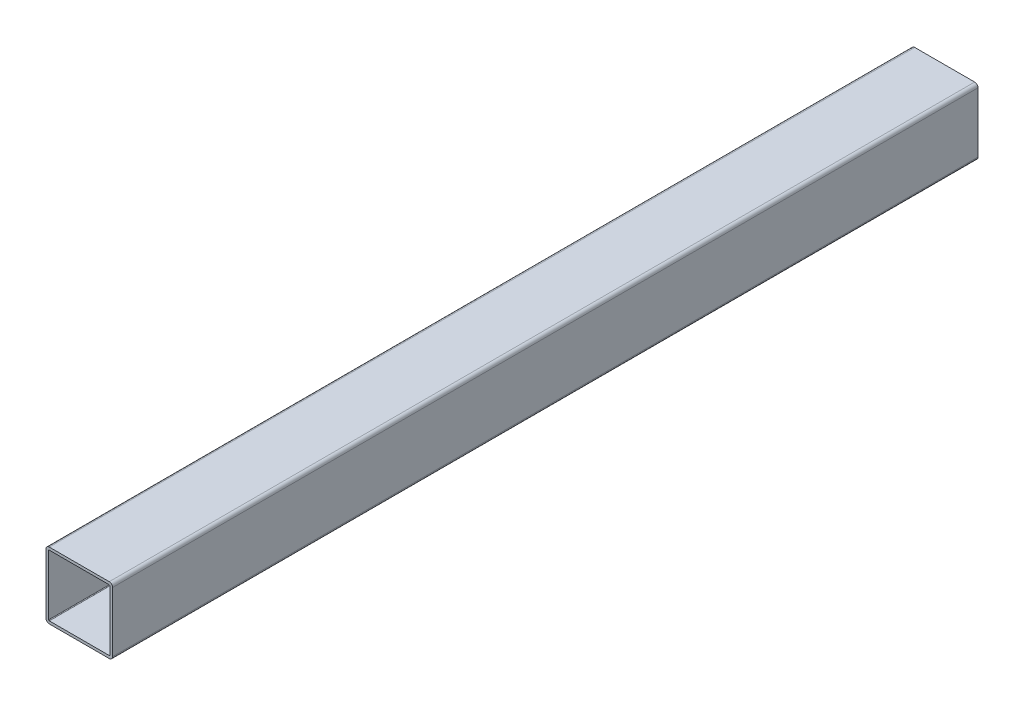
ISO-10303-21;
HEADER;
FILE_DESCRIPTION(('STEP AP214'),'2;1');
FILE_NAME('part.step','',(''),(''),'','','');
FILE_SCHEMA(('AUTOMOTIVE_DESIGN { 1 0 10303 214 1 1 1 1 }'));
ENDSEC;
DATA;
#1=APPLICATION_CONTEXT('core data for automotive mechanical design processes');
#2=APPLICATION_PROTOCOL_DEFINITION('international standard','automotive_design',2000,#1);
#3=PRODUCT_CONTEXT('',#1,'mechanical');
#4=PRODUCT('Part','Part','',(#3));
#5=PRODUCT_RELATED_PRODUCT_CATEGORY('part','',(#4));
#6=PRODUCT_DEFINITION_FORMATION('','',#4);
#7=PRODUCT_DEFINITION_CONTEXT('part definition',#1,'design');
#8=PRODUCT_DEFINITION('design','',#6,#7);
#9=PRODUCT_DEFINITION_SHAPE('','',#8);
#10=(LENGTH_UNIT() NAMED_UNIT(*) SI_UNIT(.MILLI.,.METRE.));
#11=(NAMED_UNIT(*) PLANE_ANGLE_UNIT() SI_UNIT($,.RADIAN.));
#12=(NAMED_UNIT(*) SI_UNIT($,.STERADIAN.) SOLID_ANGLE_UNIT());
#13=UNCERTAINTY_MEASURE_WITH_UNIT(LENGTH_MEASURE(1.E-05),#10,'distance_accuracy_value','');
#14=(GEOMETRIC_REPRESENTATION_CONTEXT(3) GLOBAL_UNCERTAINTY_ASSIGNED_CONTEXT((#13)) GLOBAL_UNIT_ASSIGNED_CONTEXT((#10,
#11,#12)) REPRESENTATION_CONTEXT('',''));
#15=CARTESIAN_POINT('',(0.,0.,0.));
#16=DIRECTION('',(0.,0.,1.));
#17=DIRECTION('',(1.,0.,0.));
#18=AXIS2_PLACEMENT_3D('',#15,#16,#17);
#19=CARTESIAN_POINT('',(95.,-95.,1300.));
#20=DIRECTION('',(0.,0.,1.));
#21=DIRECTION('',(1.,0.,0.));
#22=AXIS2_PLACEMENT_3D('',#19,#20,#21);
#23=PLANE('',#22);
#24=CARTESIAN_POINT('',(95.,-95.,1300.));
#25=DIRECTION('',(0.,0.,1.));
#26=DIRECTION('',(1.,0.,0.));
#27=AXIS2_PLACEMENT_3D('',#24,#25,#26);
#28=CIRCLE('',#27,5.);
#29=CARTESIAN_POINT('',(95.,-100.,1300.));
#30=VERTEX_POINT('',#29);
#31=CARTESIAN_POINT('',(100.,-95.,1300.));
#32=VERTEX_POINT('',#31);
#33=EDGE_CURVE('E229',#30,#32,#28,.T.);
#34=ORIENTED_EDGE('',*,*,#33,.T.);
#35=DIRECTION('',(0.,1.,0.));
#36=VECTOR('',#35,1.);
#37=CARTESIAN_POINT('',(100.,-5.00000000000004,1300.));
#38=LINE('',#37,#36);
#39=CARTESIAN_POINT('',(100.,-5.00000000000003,1300.));
#40=VERTEX_POINT('',#39);
#41=EDGE_CURVE('E232',#32,#40,#38,.T.);
#42=ORIENTED_EDGE('',*,*,#41,.T.);
#43=CARTESIAN_POINT('',(95.,-5.,1300.));
#44=DIRECTION('',(0.,0.,1.));
#45=DIRECTION('',(1.,0.,0.));
#46=AXIS2_PLACEMENT_3D('',#43,#44,#45);
#47=CIRCLE('',#46,5.);
#48=CARTESIAN_POINT('',(95.,0.,1300.));
#49=VERTEX_POINT('',#48);
#50=EDGE_CURVE('E234',#40,#49,#47,.T.);
#51=ORIENTED_EDGE('',*,*,#50,.T.);
#52=DIRECTION('',(-1.,0.,0.));
#53=VECTOR('',#52,1.);
#54=CARTESIAN_POINT('',(5.00000000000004,0.,1300.));
#55=LINE('',#54,#53);
#56=CARTESIAN_POINT('',(5.00000000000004,0.,1300.));
#57=VERTEX_POINT('',#56);
#58=EDGE_CURVE('E236',#49,#57,#55,.T.);
#59=ORIENTED_EDGE('',*,*,#58,.T.);
#60=CARTESIAN_POINT('',(5.,-5.,1300.));
#61=DIRECTION('',(0.,0.,1.));
#62=DIRECTION('',(1.,0.,0.));
#63=AXIS2_PLACEMENT_3D('',#60,#61,#62);
#64=CIRCLE('',#63,5.);
#65=CARTESIAN_POINT('',(0.,-5.00000000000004,1300.));
#66=VERTEX_POINT('',#65);
#67=EDGE_CURVE('E238',#57,#66,#64,.T.);
#68=ORIENTED_EDGE('',*,*,#67,.T.);
#69=DIRECTION('',(0.,-1.,0.));
#70=VECTOR('',#69,1.);
#71=CARTESIAN_POINT('',(0.,-5.00000000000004,1300.));
#72=LINE('',#71,#70);
#73=CARTESIAN_POINT('',(0.,-95.,1300.));
#74=VERTEX_POINT('',#73);
#75=EDGE_CURVE('E240',#66,#74,#72,.T.);
#76=ORIENTED_EDGE('',*,*,#75,.T.);
#77=CARTESIAN_POINT('',(5.00000000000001,-95.,1300.));
#78=DIRECTION('',(0.,0.,1.));
#79=DIRECTION('',(1.,0.,0.));
#80=AXIS2_PLACEMENT_3D('',#77,#78,#79);
#81=CIRCLE('',#80,5.);
#82=CARTESIAN_POINT('',(5.00000000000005,-100.,1300.));
#83=VERTEX_POINT('',#82);
#84=EDGE_CURVE('E242',#74,#83,#81,.T.);
#85=ORIENTED_EDGE('',*,*,#84,.T.);
#86=DIRECTION('',(1.,0.,0.));
#87=VECTOR('',#86,1.);
#88=CARTESIAN_POINT('',(5.00000000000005,-100.,1300.));
#89=LINE('',#88,#87);
#90=EDGE_CURVE('E244',#83,#30,#89,.T.);
#91=ORIENTED_EDGE('',*,*,#90,.T.);
#92=EDGE_LOOP('',(#34,#42,#51,#59,#68,#76,#85,#91));
#93=FACE_BOUND('',#92,.T.);
#94=DIRECTION('',(0.,-1.,0.));
#95=VECTOR('',#94,1.);
#96=CARTESIAN_POINT('',(4.,-5.00000000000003,1300.));
#97=LINE('',#96,#95);
#98=CARTESIAN_POINT('',(4.,-5.00000000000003,1300.));
#99=VERTEX_POINT('',#98);
#100=CARTESIAN_POINT('',(4.00000000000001,-95.,1300.));
#101=VERTEX_POINT('',#100);
#102=EDGE_CURVE('E187',#99,#101,#97,.T.);
#103=ORIENTED_EDGE('',*,*,#102,.F.);
#104=CARTESIAN_POINT('',(5.,-5.,1300.));
#105=DIRECTION('',(0.,0.,1.));
#106=DIRECTION('',(1.,0.,0.));
#107=AXIS2_PLACEMENT_3D('',#104,#105,#106);
#108=CIRCLE('',#107,0.999999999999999);
#109=CARTESIAN_POINT('',(5.00000000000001,-4.,1300.));
#110=VERTEX_POINT('',#109);
#111=EDGE_CURVE('E159',#110,#99,#108,.T.);
#112=ORIENTED_EDGE('',*,*,#111,.F.);
#113=DIRECTION('',(-1.,0.,0.));
#114=VECTOR('',#113,1.);
#115=CARTESIAN_POINT('',(5.00000000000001,-4.,1300.));
#116=LINE('',#115,#114);
#117=CARTESIAN_POINT('',(95.,-4.,1300.));
#118=VERTEX_POINT('',#117);
#119=EDGE_CURVE('E199',#118,#110,#116,.T.);
#120=ORIENTED_EDGE('',*,*,#119,.F.);
#121=CARTESIAN_POINT('',(95.,-5.,1300.));
#122=DIRECTION('',(0.,0.,1.));
#123=DIRECTION('',(1.,0.,0.));
#124=AXIS2_PLACEMENT_3D('',#121,#122,#123);
#125=CIRCLE('',#124,1.);
#126=CARTESIAN_POINT('',(96.,-5.00000000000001,1300.));
#127=VERTEX_POINT('',#126);
#128=EDGE_CURVE('E197',#127,#118,#125,.T.);
#129=ORIENTED_EDGE('',*,*,#128,.F.);
#130=DIRECTION('',(0.,1.,0.));
#131=VECTOR('',#130,1.);
#132=CARTESIAN_POINT('',(96.,-5.00000000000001,1300.));
#133=LINE('',#132,#131);
#134=CARTESIAN_POINT('',(96.,-95.,1300.));
#135=VERTEX_POINT('',#134);
#136=EDGE_CURVE('E195',#135,#127,#133,.T.);
#137=ORIENTED_EDGE('',*,*,#136,.F.);
#138=CARTESIAN_POINT('',(95.,-95.,1300.));
#139=DIRECTION('',(0.,0.,1.));
#140=DIRECTION('',(1.,0.,0.));
#141=AXIS2_PLACEMENT_3D('',#138,#139,#140);
#142=CIRCLE('',#141,1.);
#143=CARTESIAN_POINT('',(95.,-96.,1300.));
#144=VERTEX_POINT('',#143);
#145=EDGE_CURVE('E193',#144,#135,#142,.T.);
#146=ORIENTED_EDGE('',*,*,#145,.F.);
#147=DIRECTION('',(1.,0.,0.));
#148=VECTOR('',#147,1.);
#149=CARTESIAN_POINT('',(5.00000000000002,-96.,1300.));
#150=LINE('',#149,#148);
#151=CARTESIAN_POINT('',(5.00000000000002,-96.,1300.));
#152=VERTEX_POINT('',#151);
#153=EDGE_CURVE('E191',#152,#144,#150,.T.);
#154=ORIENTED_EDGE('',*,*,#153,.F.);
#155=CARTESIAN_POINT('',(5.00000000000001,-95.,1300.));
#156=DIRECTION('',(0.,0.,1.));
#157=DIRECTION('',(1.,0.,0.));
#158=AXIS2_PLACEMENT_3D('',#155,#156,#157);
#159=CIRCLE('',#158,1.);
#160=EDGE_CURVE('E189',#101,#152,#159,.T.);
#161=ORIENTED_EDGE('',*,*,#160,.F.);
#162=EDGE_LOOP('',(#103,#112,#120,#129,#137,#146,#154,#161));
#163=FACE_BOUND('',#162,.T.);
#164=ADVANCED_FACE('F29',(#93,#163),#23,.T.);
#165=CARTESIAN_POINT('',(95.,-95.,0.));
#166=DIRECTION('',(0.,0.,1.));
#167=DIRECTION('',(1.,0.,0.));
#168=AXIS2_PLACEMENT_3D('',#165,#166,#167);
#169=PLANE('',#168);
#170=CARTESIAN_POINT('',(95.,-95.,0.));
#171=DIRECTION('',(0.,0.,1.));
#172=DIRECTION('',(1.,0.,0.));
#173=AXIS2_PLACEMENT_3D('',#170,#171,#172);
#174=CIRCLE('',#173,5.);
#175=CARTESIAN_POINT('',(95.,-100.,0.));
#176=VERTEX_POINT('',#175);
#177=CARTESIAN_POINT('',(100.,-95.,0.));
#178=VERTEX_POINT('',#177);
#179=EDGE_CURVE('E160',#176,#178,#174,.T.);
#180=ORIENTED_EDGE('',*,*,#179,.F.);
#181=DIRECTION('',(1.,0.,0.));
#182=VECTOR('',#181,1.);
#183=CARTESIAN_POINT('',(5.00000000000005,-100.,0.));
#184=LINE('',#183,#182);
#185=CARTESIAN_POINT('',(5.00000000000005,-100.,0.));
#186=VERTEX_POINT('',#185);
#187=EDGE_CURVE('E227',#186,#176,#184,.T.);
#188=ORIENTED_EDGE('',*,*,#187,.F.);
#189=CARTESIAN_POINT('',(5.00000000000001,-95.,0.));
#190=DIRECTION('',(0.,0.,1.));
#191=DIRECTION('',(1.,0.,0.));
#192=AXIS2_PLACEMENT_3D('',#189,#190,#191);
#193=CIRCLE('',#192,5.);
#194=CARTESIAN_POINT('',(0.,-95.,0.));
#195=VERTEX_POINT('',#194);
#196=EDGE_CURVE('E225',#195,#186,#193,.T.);
#197=ORIENTED_EDGE('',*,*,#196,.F.);
#198=DIRECTION('',(0.,-1.,0.));
#199=VECTOR('',#198,1.);
#200=CARTESIAN_POINT('',(0.,-5.00000000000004,0.));
#201=LINE('',#200,#199);
#202=CARTESIAN_POINT('',(0.,-5.00000000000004,0.));
#203=VERTEX_POINT('',#202);
#204=EDGE_CURVE('E223',#203,#195,#201,.T.);
#205=ORIENTED_EDGE('',*,*,#204,.F.);
#206=CARTESIAN_POINT('',(5.,-5.,0.));
#207=DIRECTION('',(0.,0.,1.));
#208=DIRECTION('',(1.,0.,0.));
#209=AXIS2_PLACEMENT_3D('',#206,#207,#208);
#210=CIRCLE('',#209,5.);
#211=CARTESIAN_POINT('',(5.00000000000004,0.,0.));
#212=VERTEX_POINT('',#211);
#213=EDGE_CURVE('E221',#212,#203,#210,.T.);
#214=ORIENTED_EDGE('',*,*,#213,.F.);
#215=DIRECTION('',(-1.,0.,0.));
#216=VECTOR('',#215,1.);
#217=CARTESIAN_POINT('',(5.00000000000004,0.,0.));
#218=LINE('',#217,#216);
#219=CARTESIAN_POINT('',(95.,0.,0.));
#220=VERTEX_POINT('',#219);
#221=EDGE_CURVE('E219',#220,#212,#218,.T.);
#222=ORIENTED_EDGE('',*,*,#221,.F.);
#223=CARTESIAN_POINT('',(95.,-5.,0.));
#224=DIRECTION('',(0.,0.,1.));
#225=DIRECTION('',(1.,0.,0.));
#226=AXIS2_PLACEMENT_3D('',#223,#224,#225);
#227=CIRCLE('',#226,5.);
#228=CARTESIAN_POINT('',(100.,-5.00000000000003,0.));
#229=VERTEX_POINT('',#228);
#230=EDGE_CURVE('E217',#229,#220,#227,.T.);
#231=ORIENTED_EDGE('',*,*,#230,.F.);
#232=DIRECTION('',(0.,1.,0.));
#233=VECTOR('',#232,1.);
#234=CARTESIAN_POINT('',(100.,-5.00000000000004,0.));
#235=LINE('',#234,#233);
#236=EDGE_CURVE('E215',#178,#229,#235,.T.);
#237=ORIENTED_EDGE('',*,*,#236,.F.);
#238=EDGE_LOOP('',(#180,#188,#197,#205,#214,#222,#231,#237));
#239=FACE_BOUND('',#238,.T.);
#240=CARTESIAN_POINT('',(5.,-5.,0.));
#241=DIRECTION('',(0.,0.,1.));
#242=DIRECTION('',(1.,0.,0.));
#243=AXIS2_PLACEMENT_3D('',#240,#241,#242);
#244=CIRCLE('',#243,0.999999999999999);
#245=CARTESIAN_POINT('',(5.,-4.,0.));
#246=VERTEX_POINT('',#245);
#247=CARTESIAN_POINT('',(4.,-5.00000000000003,0.));
#248=VERTEX_POINT('',#247);
#249=EDGE_CURVE('E54',#246,#248,#244,.T.);
#250=ORIENTED_EDGE('',*,*,#249,.T.);
#251=DIRECTION('',(0.,-1.,0.));
#252=VECTOR('',#251,1.);
#253=CARTESIAN_POINT('',(4.,-5.00000000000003,0.));
#254=LINE('',#253,#252);
#255=CARTESIAN_POINT('',(4.00000000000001,-95.,0.));
#256=VERTEX_POINT('',#255);
#257=EDGE_CURVE('E146',#248,#256,#254,.T.);
#258=ORIENTED_EDGE('',*,*,#257,.T.);
#259=CARTESIAN_POINT('',(5.00000000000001,-95.,0.));
#260=DIRECTION('',(0.,0.,1.));
#261=DIRECTION('',(1.,0.,0.));
#262=AXIS2_PLACEMENT_3D('',#259,#260,#261);
#263=CIRCLE('',#262,1.);
#264=CARTESIAN_POINT('',(5.00000000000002,-96.,0.));
#265=VERTEX_POINT('',#264);
#266=EDGE_CURVE('E155',#256,#265,#263,.T.);
#267=ORIENTED_EDGE('',*,*,#266,.T.);
#268=DIRECTION('',(1.,0.,0.));
#269=VECTOR('',#268,1.);
#270=CARTESIAN_POINT('',(5.00000000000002,-96.,0.));
#271=LINE('',#270,#269);
#272=CARTESIAN_POINT('',(95.,-96.,0.));
#273=VERTEX_POINT('',#272);
#274=EDGE_CURVE('E174',#265,#273,#271,.T.);
#275=ORIENTED_EDGE('',*,*,#274,.T.);
#276=CARTESIAN_POINT('',(95.,-95.,0.));
#277=DIRECTION('',(0.,0.,1.));
#278=DIRECTION('',(1.,0.,0.));
#279=AXIS2_PLACEMENT_3D('',#276,#277,#278);
#280=CIRCLE('',#279,1.);
#281=CARTESIAN_POINT('',(96.,-95.,0.));
#282=VERTEX_POINT('',#281);
#283=EDGE_CURVE('E177',#273,#282,#280,.T.);
#284=ORIENTED_EDGE('',*,*,#283,.T.);
#285=DIRECTION('',(0.,1.,0.));
#286=VECTOR('',#285,1.);
#287=CARTESIAN_POINT('',(96.,-5.00000000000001,0.));
#288=LINE('',#287,#286);
#289=CARTESIAN_POINT('',(96.,-5.00000000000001,0.));
#290=VERTEX_POINT('',#289);
#291=EDGE_CURVE('E180',#282,#290,#288,.T.);
#292=ORIENTED_EDGE('',*,*,#291,.T.);
#293=CARTESIAN_POINT('',(95.,-5.,0.));
#294=DIRECTION('',(0.,0.,1.));
#295=DIRECTION('',(1.,0.,0.));
#296=AXIS2_PLACEMENT_3D('',#293,#294,#295);
#297=CIRCLE('',#296,1.);
#298=CARTESIAN_POINT('',(95.,-4.,0.));
#299=VERTEX_POINT('',#298);
#300=EDGE_CURVE('E183',#290,#299,#297,.T.);
#301=ORIENTED_EDGE('',*,*,#300,.T.);
#302=DIRECTION('',(-1.,0.,0.));
#303=VECTOR('',#302,1.);
#304=CARTESIAN_POINT('',(5.00000000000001,-4.,0.));
#305=LINE('',#304,#303);
#306=EDGE_CURVE('E165',#299,#246,#305,.T.);
#307=ORIENTED_EDGE('',*,*,#306,.T.);
#308=EDGE_LOOP('',(#250,#258,#267,#275,#284,#292,#301,#307));
#309=FACE_BOUND('',#308,.T.);
#310=ADVANCED_FACE('F163',(#239,#309),#169,.F.);
#311=CARTESIAN_POINT('',(95.,-95.,1300.));
#312=DIRECTION('',(0.,0.,-1.));
#313=DIRECTION('',(-1.,0.,0.));
#314=AXIS2_PLACEMENT_3D('',#311,#312,#313);
#315=CYLINDRICAL_SURFACE('',#314,5.);
#316=ORIENTED_EDGE('',*,*,#179,.T.);
#317=DIRECTION('',(0.,0.,-1.));
#318=VECTOR('',#317,1.);
#319=CARTESIAN_POINT('',(100.,-95.,1300.));
#320=LINE('',#319,#318);
#321=EDGE_CURVE('E11',#32,#178,#320,.T.);
#322=ORIENTED_EDGE('',*,*,#321,.F.);
#323=ORIENTED_EDGE('',*,*,#33,.F.);
#324=DIRECTION('',(0.,0.,-1.));
#325=VECTOR('',#324,1.);
#326=CARTESIAN_POINT('',(95.,-100.,1300.));
#327=LINE('',#326,#325);
#328=EDGE_CURVE('E246',#30,#176,#327,.T.);
#329=ORIENTED_EDGE('',*,*,#328,.T.);
#330=EDGE_LOOP('',(#316,#322,#323,#329));
#331=FACE_BOUND('',#330,.T.);
#332=ADVANCED_FACE('F31',(#331),#315,.T.);
#333=CARTESIAN_POINT('',(100.,-5.00000000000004,1300.));
#334=DIRECTION('',(-1.,0.,0.));
#335=DIRECTION('',(0.,0.,1.));
#336=AXIS2_PLACEMENT_3D('',#333,#334,#335);
#337=PLANE('',#336);
#338=ORIENTED_EDGE('',*,*,#236,.T.);
#339=DIRECTION('',(0.,0.,-1.));
#340=VECTOR('',#339,1.);
#341=CARTESIAN_POINT('',(100.,-5.00000000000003,1300.));
#342=LINE('',#341,#340);
#343=EDGE_CURVE('E38',#40,#229,#342,.T.);
#344=ORIENTED_EDGE('',*,*,#343,.F.);
#345=ORIENTED_EDGE('',*,*,#41,.F.);
#346=ORIENTED_EDGE('',*,*,#321,.T.);
#347=EDGE_LOOP('',(#338,#344,#345,#346));
#348=FACE_BOUND('',#347,.T.);
#349=ADVANCED_FACE('F291',(#348),#337,.F.);
#350=CARTESIAN_POINT('',(95.,-5.,1300.));
#351=DIRECTION('',(0.,0.,-1.));
#352=DIRECTION('',(-1.,0.,0.));
#353=AXIS2_PLACEMENT_3D('',#350,#351,#352);
#354=CYLINDRICAL_SURFACE('',#353,5.);
#355=ORIENTED_EDGE('',*,*,#230,.T.);
#356=DIRECTION('',(0.,0.,-1.));
#357=VECTOR('',#356,1.);
#358=CARTESIAN_POINT('',(95.,0.,1300.));
#359=LINE('',#358,#357);
#360=EDGE_CURVE('E261',#49,#220,#359,.T.);
#361=ORIENTED_EDGE('',*,*,#360,.F.);
#362=ORIENTED_EDGE('',*,*,#50,.F.);
#363=ORIENTED_EDGE('',*,*,#343,.T.);
#364=EDGE_LOOP('',(#355,#361,#362,#363));
#365=FACE_BOUND('',#364,.T.);
#366=ADVANCED_FACE('F269',(#365),#354,.T.);
#367=CARTESIAN_POINT('',(5.00000000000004,0.,1300.));
#368=DIRECTION('',(0.,-1.,0.));
#369=DIRECTION('',(0.,0.,-1.));
#370=AXIS2_PLACEMENT_3D('',#367,#368,#369);
#371=PLANE('',#370);
#372=ORIENTED_EDGE('',*,*,#221,.T.);
#373=DIRECTION('',(0.,0.,-1.));
#374=VECTOR('',#373,1.);
#375=CARTESIAN_POINT('',(5.00000000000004,0.,1300.));
#376=LINE('',#375,#374);
#377=EDGE_CURVE('E258',#57,#212,#376,.T.);
#378=ORIENTED_EDGE('',*,*,#377,.F.);
#379=ORIENTED_EDGE('',*,*,#58,.F.);
#380=ORIENTED_EDGE('',*,*,#360,.T.);
#381=EDGE_LOOP('',(#372,#378,#379,#380));
#382=FACE_BOUND('',#381,.T.);
#383=ADVANCED_FACE('F279',(#382),#371,.F.);
#384=CARTESIAN_POINT('',(5.,-5.,1300.));
#385=DIRECTION('',(0.,0.,-1.));
#386=DIRECTION('',(-1.,0.,0.));
#387=AXIS2_PLACEMENT_3D('',#384,#385,#386);
#388=CYLINDRICAL_SURFACE('',#387,5.);
#389=ORIENTED_EDGE('',*,*,#213,.T.);
#390=DIRECTION('',(0.,0.,-1.));
#391=VECTOR('',#390,1.);
#392=CARTESIAN_POINT('',(0.,-5.00000000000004,1300.));
#393=LINE('',#392,#391);
#394=EDGE_CURVE('E255',#66,#203,#393,.T.);
#395=ORIENTED_EDGE('',*,*,#394,.F.);
#396=ORIENTED_EDGE('',*,*,#67,.F.);
#397=ORIENTED_EDGE('',*,*,#377,.T.);
#398=EDGE_LOOP('',(#389,#395,#396,#397));
#399=FACE_BOUND('',#398,.T.);
#400=ADVANCED_FACE('F283',(#399),#388,.T.);
#401=CARTESIAN_POINT('',(0.,-5.00000000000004,1300.));
#402=DIRECTION('',(1.,0.,0.));
#403=DIRECTION('',(0.,1.,0.));
#404=AXIS2_PLACEMENT_3D('',#401,#402,#403);
#405=PLANE('',#404);
#406=CARTESIAN_POINT('',(0.,-49.9999999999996,1000.));
#407=DIRECTION('',(-1.,0.,0.));
#408=DIRECTION('',(0.,-1.,0.));
#409=AXIS2_PLACEMENT_3D('',#406,#407,#408);
#410=CIRCLE('',#409,2.49999999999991);
#411=CARTESIAN_POINT('',(0.,-52.4999999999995,1000.));
#412=VERTEX_POINT('',#411);
#413=EDGE_CURVE('E370',#412,#412,#410,.T.);
#414=ORIENTED_EDGE('',*,*,#413,.F.);
#415=EDGE_LOOP('',(#414));
#416=FACE_BOUND('',#415,.T.);
#417=CARTESIAN_POINT('',(0.,-49.9999999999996,300.));
#418=DIRECTION('',(-1.,0.,0.));
#419=DIRECTION('',(0.,-1.,0.));
#420=AXIS2_PLACEMENT_3D('',#417,#418,#419);
#421=CIRCLE('',#420,2.50000000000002);
#422=CARTESIAN_POINT('',(0.,-52.4999999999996,300.));
#423=VERTEX_POINT('',#422);
#424=EDGE_CURVE('E169',#423,#423,#421,.T.);
#425=ORIENTED_EDGE('',*,*,#424,.F.);
#426=EDGE_LOOP('',(#425));
#427=FACE_BOUND('',#426,.T.);
#428=ORIENTED_EDGE('',*,*,#204,.T.);
#429=DIRECTION('',(0.,0.,-1.));
#430=VECTOR('',#429,1.);
#431=CARTESIAN_POINT('',(0.,-95.,1300.));
#432=LINE('',#431,#430);
#433=EDGE_CURVE('E252',#74,#195,#432,.T.);
#434=ORIENTED_EDGE('',*,*,#433,.F.);
#435=ORIENTED_EDGE('',*,*,#75,.F.);
#436=ORIENTED_EDGE('',*,*,#394,.T.);
#437=EDGE_LOOP('',(#428,#434,#435,#436));
#438=FACE_BOUND('',#437,.T.);
#439=ADVANCED_FACE('F304',(#416,#427,#438),#405,.F.);
#440=CARTESIAN_POINT('',(5.00000000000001,-95.,1300.));
#441=DIRECTION('',(0.,0.,-1.));
#442=DIRECTION('',(-1.,0.,0.));
#443=AXIS2_PLACEMENT_3D('',#440,#441,#442);
#444=CYLINDRICAL_SURFACE('',#443,5.);
#445=ORIENTED_EDGE('',*,*,#196,.T.);
#446=DIRECTION('',(0.,0.,-1.));
#447=VECTOR('',#446,1.);
#448=CARTESIAN_POINT('',(5.00000000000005,-100.,1300.));
#449=LINE('',#448,#447);
#450=EDGE_CURVE('E249',#83,#186,#449,.T.);
#451=ORIENTED_EDGE('',*,*,#450,.F.);
#452=ORIENTED_EDGE('',*,*,#84,.F.);
#453=ORIENTED_EDGE('',*,*,#433,.T.);
#454=EDGE_LOOP('',(#445,#451,#452,#453));
#455=FACE_BOUND('',#454,.T.);
#456=ADVANCED_FACE('F302',(#455),#444,.T.);
#457=CARTESIAN_POINT('',(5.00000000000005,-100.,1300.));
#458=DIRECTION('',(0.,1.,0.));
#459=DIRECTION('',(0.,0.,1.));
#460=AXIS2_PLACEMENT_3D('',#457,#458,#459);
#461=PLANE('',#460);
#462=ORIENTED_EDGE('',*,*,#187,.T.);
#463=ORIENTED_EDGE('',*,*,#328,.F.);
#464=ORIENTED_EDGE('',*,*,#90,.F.);
#465=ORIENTED_EDGE('',*,*,#450,.T.);
#466=EDGE_LOOP('',(#462,#463,#464,#465));
#467=FACE_BOUND('',#466,.T.);
#468=ADVANCED_FACE('F297',(#467),#461,.F.);
#469=CARTESIAN_POINT('',(5.,-5.,1300.));
#470=DIRECTION('',(0.,0.,-1.));
#471=DIRECTION('',(-1.,0.,0.));
#472=AXIS2_PLACEMENT_3D('',#469,#470,#471);
#473=CYLINDRICAL_SURFACE('',#472,0.999999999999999);
#474=ORIENTED_EDGE('',*,*,#249,.F.);
#475=DIRECTION('',(0.,0.,-1.));
#476=VECTOR('',#475,1.);
#477=CARTESIAN_POINT('',(5.00000000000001,-4.,1300.));
#478=LINE('',#477,#476);
#479=EDGE_CURVE('E201',#110,#246,#478,.T.);
#480=ORIENTED_EDGE('',*,*,#479,.F.);
#481=ORIENTED_EDGE('',*,*,#111,.T.);
#482=DIRECTION('',(0.,0.,-1.));
#483=VECTOR('',#482,1.);
#484=CARTESIAN_POINT('',(4.,-5.00000000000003,1300.));
#485=LINE('',#484,#483);
#486=EDGE_CURVE('E148',#99,#248,#485,.T.);
#487=ORIENTED_EDGE('',*,*,#486,.T.);
#488=EDGE_LOOP('',(#474,#480,#481,#487));
#489=FACE_BOUND('',#488,.T.);
#490=ADVANCED_FACE('F157',(#489),#473,.F.);
#491=CARTESIAN_POINT('',(4.,-5.00000000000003,1300.));
#492=DIRECTION('',(1.,0.,0.));
#493=DIRECTION('',(0.,1.,0.));
#494=AXIS2_PLACEMENT_3D('',#491,#492,#493);
#495=PLANE('',#494);
#496=CARTESIAN_POINT('',(4.00000000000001,-49.9999999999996,1000.));
#497=DIRECTION('',(1.,0.,0.));
#498=DIRECTION('',(0.,1.,0.));
#499=AXIS2_PLACEMENT_3D('',#496,#497,#498);
#500=CIRCLE('',#499,2.49999999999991);
#501=CARTESIAN_POINT('',(4.00000000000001,-47.4999999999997,1000.));
#502=VERTEX_POINT('',#501);
#503=EDGE_CURVE('E33',#502,#502,#500,.T.);
#504=ORIENTED_EDGE('',*,*,#503,.F.);
#505=EDGE_LOOP('',(#504));
#506=FACE_BOUND('',#505,.T.);
#507=CARTESIAN_POINT('',(4.00000000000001,-49.9999999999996,300.));
#508=DIRECTION('',(1.,0.,0.));
#509=DIRECTION('',(0.,1.,0.));
#510=AXIS2_PLACEMENT_3D('',#507,#508,#509);
#511=CIRCLE('',#510,2.50000000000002);
#512=CARTESIAN_POINT('',(4.00000000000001,-47.4999999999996,300.));
#513=VERTEX_POINT('',#512);
#514=EDGE_CURVE('E166',#513,#513,#511,.T.);
#515=ORIENTED_EDGE('',*,*,#514,.F.);
#516=EDGE_LOOP('',(#515));
#517=FACE_BOUND('',#516,.T.);
#518=ORIENTED_EDGE('',*,*,#257,.F.);
#519=ORIENTED_EDGE('',*,*,#486,.F.);
#520=ORIENTED_EDGE('',*,*,#102,.T.);
#521=DIRECTION('',(0.,0.,-1.));
#522=VECTOR('',#521,1.);
#523=CARTESIAN_POINT('',(4.00000000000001,-95.,1300.));
#524=LINE('',#523,#522);
#525=EDGE_CURVE('E151',#101,#256,#524,.T.);
#526=ORIENTED_EDGE('',*,*,#525,.T.);
#527=EDGE_LOOP('',(#518,#519,#520,#526));
#528=FACE_BOUND('',#527,.T.);
#529=ADVANCED_FACE('F147',(#506,#517,#528),#495,.T.);
#530=CARTESIAN_POINT('',(5.00000000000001,-95.,1300.));
#531=DIRECTION('',(0.,0.,-1.));
#532=DIRECTION('',(-1.,0.,0.));
#533=AXIS2_PLACEMENT_3D('',#530,#531,#532);
#534=CYLINDRICAL_SURFACE('',#533,1.);
#535=ORIENTED_EDGE('',*,*,#266,.F.);
#536=ORIENTED_EDGE('',*,*,#525,.F.);
#537=ORIENTED_EDGE('',*,*,#160,.T.);
#538=DIRECTION('',(0.,0.,-1.));
#539=VECTOR('',#538,1.);
#540=CARTESIAN_POINT('',(5.00000000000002,-96.,1300.));
#541=LINE('',#540,#539);
#542=EDGE_CURVE('E210',#152,#265,#541,.T.);
#543=ORIENTED_EDGE('',*,*,#542,.T.);
#544=EDGE_LOOP('',(#535,#536,#537,#543));
#545=FACE_BOUND('',#544,.T.);
#546=ADVANCED_FACE('F331',(#545),#534,.F.);
#547=CARTESIAN_POINT('',(5.00000000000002,-96.,1300.));
#548=DIRECTION('',(0.,1.,0.));
#549=DIRECTION('',(0.,0.,1.));
#550=AXIS2_PLACEMENT_3D('',#547,#548,#549);
#551=PLANE('',#550);
#552=ORIENTED_EDGE('',*,*,#274,.F.);
#553=ORIENTED_EDGE('',*,*,#542,.F.);
#554=ORIENTED_EDGE('',*,*,#153,.T.);
#555=DIRECTION('',(0.,0.,-1.));
#556=VECTOR('',#555,1.);
#557=CARTESIAN_POINT('',(95.,-96.,1300.));
#558=LINE('',#557,#556);
#559=EDGE_CURVE('E208',#144,#273,#558,.T.);
#560=ORIENTED_EDGE('',*,*,#559,.T.);
#561=EDGE_LOOP('',(#552,#553,#554,#560));
#562=FACE_BOUND('',#561,.T.);
#563=ADVANCED_FACE('F337',(#562),#551,.T.);
#564=CARTESIAN_POINT('',(95.,-95.,1300.));
#565=DIRECTION('',(0.,0.,-1.));
#566=DIRECTION('',(-1.,0.,0.));
#567=AXIS2_PLACEMENT_3D('',#564,#565,#566);
#568=CYLINDRICAL_SURFACE('',#567,1.);
#569=ORIENTED_EDGE('',*,*,#283,.F.);
#570=ORIENTED_EDGE('',*,*,#559,.F.);
#571=ORIENTED_EDGE('',*,*,#145,.T.);
#572=DIRECTION('',(0.,0.,-1.));
#573=VECTOR('',#572,1.);
#574=CARTESIAN_POINT('',(96.,-95.,1300.));
#575=LINE('',#574,#573);
#576=EDGE_CURVE('E206',#135,#282,#575,.T.);
#577=ORIENTED_EDGE('',*,*,#576,.T.);
#578=EDGE_LOOP('',(#569,#570,#571,#577));
#579=FACE_BOUND('',#578,.T.);
#580=ADVANCED_FACE('F341',(#579),#568,.F.);
#581=CARTESIAN_POINT('',(96.,-5.00000000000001,1300.));
#582=DIRECTION('',(-1.,0.,0.));
#583=DIRECTION('',(0.,0.,1.));
#584=AXIS2_PLACEMENT_3D('',#581,#582,#583);
#585=PLANE('',#584);
#586=ORIENTED_EDGE('',*,*,#291,.F.);
#587=ORIENTED_EDGE('',*,*,#576,.F.);
#588=ORIENTED_EDGE('',*,*,#136,.T.);
#589=DIRECTION('',(0.,0.,-1.));
#590=VECTOR('',#589,1.);
#591=CARTESIAN_POINT('',(96.,-5.00000000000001,1300.));
#592=LINE('',#591,#590);
#593=EDGE_CURVE('E204',#127,#290,#592,.T.);
#594=ORIENTED_EDGE('',*,*,#593,.T.);
#595=EDGE_LOOP('',(#586,#587,#588,#594));
#596=FACE_BOUND('',#595,.T.);
#597=ADVANCED_FACE('F345',(#596),#585,.T.);
#598=CARTESIAN_POINT('',(95.,-5.,1300.));
#599=DIRECTION('',(0.,0.,-1.));
#600=DIRECTION('',(-1.,0.,0.));
#601=AXIS2_PLACEMENT_3D('',#598,#599,#600);
#602=CYLINDRICAL_SURFACE('',#601,1.);
#603=ORIENTED_EDGE('',*,*,#300,.F.);
#604=ORIENTED_EDGE('',*,*,#593,.F.);
#605=ORIENTED_EDGE('',*,*,#128,.T.);
#606=DIRECTION('',(0.,0.,-1.));
#607=VECTOR('',#606,1.);
#608=CARTESIAN_POINT('',(95.,-4.,1300.));
#609=LINE('',#608,#607);
#610=EDGE_CURVE('E46',#118,#299,#609,.T.);
#611=ORIENTED_EDGE('',*,*,#610,.T.);
#612=EDGE_LOOP('',(#603,#604,#605,#611));
#613=FACE_BOUND('',#612,.T.);
#614=ADVANCED_FACE('F349',(#613),#602,.F.);
#615=CARTESIAN_POINT('',(5.00000000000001,-4.,1300.));
#616=DIRECTION('',(0.,-1.,0.));
#617=DIRECTION('',(0.,0.,-1.));
#618=AXIS2_PLACEMENT_3D('',#615,#616,#617);
#619=PLANE('',#618);
#620=ORIENTED_EDGE('',*,*,#306,.F.);
#621=ORIENTED_EDGE('',*,*,#610,.F.);
#622=ORIENTED_EDGE('',*,*,#119,.T.);
#623=ORIENTED_EDGE('',*,*,#479,.T.);
#624=EDGE_LOOP('',(#620,#621,#622,#623));
#625=FACE_BOUND('',#624,.T.);
#626=ADVANCED_FACE('F353',(#625),#619,.T.);
#627=CARTESIAN_POINT('',(6.00000000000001,-49.9999999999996,300.));
#628=DIRECTION('',(-1.,0.,0.));
#629=DIRECTION('',(0.,-1.,0.));
#630=AXIS2_PLACEMENT_3D('',#627,#628,#629);
#631=CYLINDRICAL_SURFACE('',#630,2.50000000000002);
#632=ORIENTED_EDGE('',*,*,#514,.T.);
#633=EDGE_LOOP('',(#632));
#634=FACE_BOUND('',#633,.T.);
#635=ORIENTED_EDGE('',*,*,#424,.T.);
#636=EDGE_LOOP('',(#635));
#637=FACE_BOUND('',#636,.T.);
#638=ADVANCED_FACE('F357',(#634,#637),#631,.F.);
#639=CARTESIAN_POINT('',(6.00000000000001,-49.9999999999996,1000.));
#640=DIRECTION('',(-1.,0.,0.));
#641=DIRECTION('',(0.,-1.,0.));
#642=AXIS2_PLACEMENT_3D('',#639,#640,#641);
#643=CYLINDRICAL_SURFACE('',#642,2.49999999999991);
#644=ORIENTED_EDGE('',*,*,#503,.T.);
#645=EDGE_LOOP('',(#644));
#646=FACE_BOUND('',#645,.T.);
#647=ORIENTED_EDGE('',*,*,#413,.T.);
#648=EDGE_LOOP('',(#647));
#649=FACE_BOUND('',#648,.T.);
#650=ADVANCED_FACE('F360',(#646,#649),#643,.F.);
#651=CLOSED_SHELL('',(#164,#310,#332,#349,#366,#383,#400,#439,#456,#468,#490,#529,#546,#563,
#580,#597,#614,#626,#638,#650));
#652=MANIFOLD_SOLID_BREP('B2',#651);
#653=ADVANCED_BREP_SHAPE_REPRESENTATION('',(#18,#652),#14);
#654=SHAPE_DEFINITION_REPRESENTATION(#9,#653);
ENDSEC;
END-ISO-10303-21;
